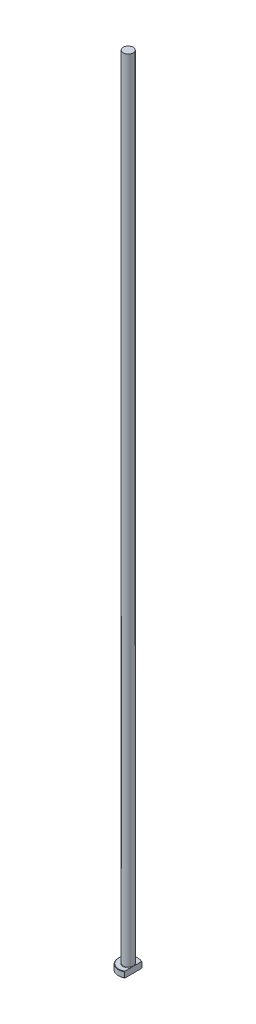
from build123d import *
from build123d.topology import SkipClean

# Parameters (mm, degrees)
CHAMFER1_SIZE = 0.2
FILLET1_R     = 0.2
KEY_DEPTH     = 401.062495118


with BuildPart() as part:
    # Sketch1 → Revolve1 (revolve)
    with BuildSketch(Plane.XY, mode=Mode.PRIVATE) as revolve1_sk:
        Polygon((0, 0), (-5, 0), (-5, 3), (-2.5, 3), (-2.5, 400), (0, 400), align=None)
    revolve(revolve1_sk.sketch.rotate(Axis((0, 259.958771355, 0), (0, -1, 0)), 270), axis=Axis((0, 259.958771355, 0), (0, -1, 0)))

    # Chamfer1
    chamfer1_edges = [part.edges().sort_by_distance(p)[0] for p in [
        (0, 3, -5),
        (0, 0, -5),
    ]]
    chamfer(chamfer1_edges, length=CHAMFER1_SIZE)

    # Fillet1
    fillet1_edges = [part.edges().sort_by_distance(p)[0] for p in [
        (0, 3, -2.5),
    ]]
    fillet(fillet1_edges, radius=FILLET1_R)

    # Sketch2 → KEY (cut, through all)
    with SkipClean():  # the faces are left unmerged after this step: merging them gives an invalid solid
        with BuildSketch(Plane(origin=(0, 0, 0), x_dir=(1, 0, 0), z_dir=(0, 1, 0))):
            with BuildLine():
                Line((2.5, 4.330127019), (2.5, -4.330127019))
                ThreePointArc((2.5, -4.330127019), (5, 0), (2.5, 4.330127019))
            make_face()
        extrude(amount=KEY_DEPTH, mode=Mode.SUBTRACT)


solid = part.part
